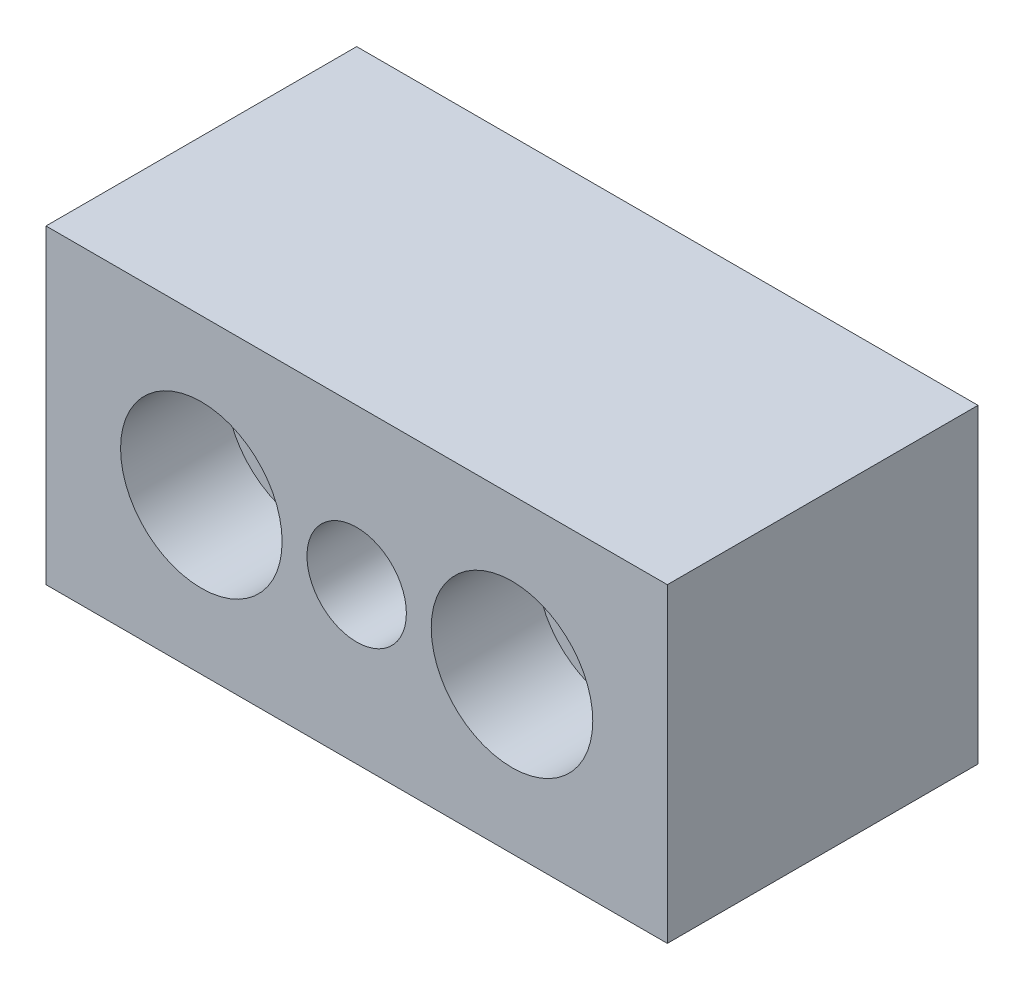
ISO-10303-21;
HEADER;
FILE_DESCRIPTION(('STEP AP214'),'2;1');
FILE_NAME('part.step','',(''),(''),'','','');
FILE_SCHEMA(('AUTOMOTIVE_DESIGN { 1 0 10303 214 1 1 1 1 }'));
ENDSEC;
DATA;
#1=APPLICATION_CONTEXT('core data for automotive mechanical design processes');
#2=APPLICATION_PROTOCOL_DEFINITION('international standard','automotive_design',2000,#1);
#3=PRODUCT_CONTEXT('',#1,'mechanical');
#4=PRODUCT('Part','Part','',(#3));
#5=PRODUCT_RELATED_PRODUCT_CATEGORY('part','',(#4));
#6=PRODUCT_DEFINITION_FORMATION('','',#4);
#7=PRODUCT_DEFINITION_CONTEXT('part definition',#1,'design');
#8=PRODUCT_DEFINITION('design','',#6,#7);
#9=PRODUCT_DEFINITION_SHAPE('','',#8);
#10=(LENGTH_UNIT() NAMED_UNIT(*) SI_UNIT(.MILLI.,.METRE.));
#11=(NAMED_UNIT(*) PLANE_ANGLE_UNIT() SI_UNIT($,.RADIAN.));
#12=(NAMED_UNIT(*) SI_UNIT($,.STERADIAN.) SOLID_ANGLE_UNIT());
#13=UNCERTAINTY_MEASURE_WITH_UNIT(LENGTH_MEASURE(1.E-05),#10,'distance_accuracy_value','');
#14=(GEOMETRIC_REPRESENTATION_CONTEXT(3) GLOBAL_UNCERTAINTY_ASSIGNED_CONTEXT((#13)) GLOBAL_UNIT_ASSIGNED_CONTEXT((#10,
#11,#12)) REPRESENTATION_CONTEXT('',''));
#15=CARTESIAN_POINT('',(0.,0.,0.));
#16=DIRECTION('',(0.,0.,1.));
#17=DIRECTION('',(1.,0.,0.));
#18=AXIS2_PLACEMENT_3D('',#15,#16,#17);
#19=CARTESIAN_POINT('',(-25.,25.,50.));
#20=DIRECTION('',(0.,0.,-1.));
#21=DIRECTION('',(-1.,0.,0.));
#22=AXIS2_PLACEMENT_3D('',#19,#20,#21);
#23=PLANE('',#22);
#24=CARTESIAN_POINT('',(25.,0.,50.));
#25=DIRECTION('',(0.,0.,1.));
#26=DIRECTION('',(1.,0.,0.));
#27=AXIS2_PLACEMENT_3D('',#24,#25,#26);
#28=CIRCLE('',#27,8.);
#29=CARTESIAN_POINT('',(33.,0.,50.));
#30=VERTEX_POINT('',#29);
#31=EDGE_CURVE('E147',#30,#30,#28,.T.);
#32=ORIENTED_EDGE('',*,*,#31,.F.);
#33=EDGE_LOOP('',(#32));
#34=FACE_BOUND('',#33,.T.);
#35=CARTESIAN_POINT('',(0.,0.,50.));
#36=DIRECTION('',(0.,0.,1.));
#37=DIRECTION('',(1.,0.,0.));
#38=AXIS2_PLACEMENT_3D('',#35,#36,#37);
#39=CIRCLE('',#38,13.);
#40=CARTESIAN_POINT('',(13.,0.,50.));
#41=VERTEX_POINT('',#40);
#42=EDGE_CURVE('E84',#41,#41,#39,.T.);
#43=ORIENTED_EDGE('',*,*,#42,.F.);
#44=EDGE_LOOP('',(#43));
#45=FACE_BOUND('',#44,.T.);
#46=DIRECTION('',(0.,1.,0.));
#47=VECTOR('',#46,1.);
#48=CARTESIAN_POINT('',(-25.,-25.,50.));
#49=LINE('',#48,#47);
#50=CARTESIAN_POINT('',(-25.,-25.,50.));
#51=VERTEX_POINT('',#50);
#52=CARTESIAN_POINT('',(-25.,25.,50.));
#53=VERTEX_POINT('',#52);
#54=EDGE_CURVE('E66',#51,#53,#49,.T.);
#55=ORIENTED_EDGE('',*,*,#54,.F.);
#56=DIRECTION('',(-1.,0.,0.));
#57=VECTOR('',#56,1.);
#58=CARTESIAN_POINT('',(75.,-25.,50.));
#59=LINE('',#58,#57);
#60=CARTESIAN_POINT('',(75.,-25.,50.));
#61=VERTEX_POINT('',#60);
#62=EDGE_CURVE('E48',#61,#51,#59,.T.);
#63=ORIENTED_EDGE('',*,*,#62,.F.);
#64=DIRECTION('',(0.,-1.,0.));
#65=VECTOR('',#64,1.);
#66=CARTESIAN_POINT('',(75.,25.,50.));
#67=LINE('',#66,#65);
#68=CARTESIAN_POINT('',(75.,25.,50.));
#69=VERTEX_POINT('',#68);
#70=EDGE_CURVE('E57',#69,#61,#67,.T.);
#71=ORIENTED_EDGE('',*,*,#70,.F.);
#72=DIRECTION('',(1.,0.,0.));
#73=VECTOR('',#72,1.);
#74=CARTESIAN_POINT('',(-25.,25.,50.));
#75=LINE('',#74,#73);
#76=EDGE_CURVE('E62',#53,#69,#75,.T.);
#77=ORIENTED_EDGE('',*,*,#76,.F.);
#78=EDGE_LOOP('',(#55,#63,#71,#77));
#79=FACE_BOUND('',#78,.T.);
#80=CARTESIAN_POINT('',(50.,0.,50.));
#81=DIRECTION('',(0.,0.,1.));
#82=DIRECTION('',(1.,0.,0.));
#83=AXIS2_PLACEMENT_3D('',#80,#81,#82);
#84=CIRCLE('',#83,13.);
#85=CARTESIAN_POINT('',(63.,0.,50.));
#86=VERTEX_POINT('',#85);
#87=EDGE_CURVE('E160',#86,#86,#84,.T.);
#88=ORIENTED_EDGE('',*,*,#87,.F.);
#89=EDGE_LOOP('',(#88));
#90=FACE_BOUND('',#89,.T.);
#91=ADVANCED_FACE('F14',(#34,#45,#79,#90),#23,.F.);
#92=CARTESIAN_POINT('',(-25.,25.,0.));
#93=DIRECTION('',(0.,0.,-1.));
#94=DIRECTION('',(-1.,0.,0.));
#95=AXIS2_PLACEMENT_3D('',#92,#93,#94);
#96=PLANE('',#95);
#97=CARTESIAN_POINT('',(0.,0.,0.));
#98=DIRECTION('',(0.,0.,1.));
#99=DIRECTION('',(1.,0.,0.));
#100=AXIS2_PLACEMENT_3D('',#97,#98,#99);
#101=CIRCLE('',#100,9.);
#102=CARTESIAN_POINT('',(9.,0.,0.));
#103=VERTEX_POINT('',#102);
#104=EDGE_CURVE('E163',#103,#103,#101,.T.);
#105=ORIENTED_EDGE('',*,*,#104,.T.);
#106=EDGE_LOOP('',(#105));
#107=FACE_BOUND('',#106,.T.);
#108=DIRECTION('',(0.,1.,0.));
#109=VECTOR('',#108,1.);
#110=CARTESIAN_POINT('',(-25.,-25.,0.));
#111=LINE('',#110,#109);
#112=CARTESIAN_POINT('',(-25.,-25.,0.));
#113=VERTEX_POINT('',#112);
#114=CARTESIAN_POINT('',(-25.,25.,0.));
#115=VERTEX_POINT('',#114);
#116=EDGE_CURVE('E67',#113,#115,#111,.T.);
#117=ORIENTED_EDGE('',*,*,#116,.T.);
#118=DIRECTION('',(1.,0.,0.));
#119=VECTOR('',#118,1.);
#120=CARTESIAN_POINT('',(-25.,25.,0.));
#121=LINE('',#120,#119);
#122=CARTESIAN_POINT('',(75.,25.,0.));
#123=VERTEX_POINT('',#122);
#124=EDGE_CURVE('E70',#115,#123,#121,.T.);
#125=ORIENTED_EDGE('',*,*,#124,.T.);
#126=DIRECTION('',(0.,-1.,0.));
#127=VECTOR('',#126,1.);
#128=CARTESIAN_POINT('',(75.,25.,0.));
#129=LINE('',#128,#127);
#130=CARTESIAN_POINT('',(75.,-25.,0.));
#131=VERTEX_POINT('',#130);
#132=EDGE_CURVE('E80',#123,#131,#129,.T.);
#133=ORIENTED_EDGE('',*,*,#132,.T.);
#134=DIRECTION('',(-1.,0.,0.));
#135=VECTOR('',#134,1.);
#136=CARTESIAN_POINT('',(75.,-25.,0.));
#137=LINE('',#136,#135);
#138=EDGE_CURVE('E51',#131,#113,#137,.T.);
#139=ORIENTED_EDGE('',*,*,#138,.T.);
#140=EDGE_LOOP('',(#117,#125,#133,#139));
#141=FACE_BOUND('',#140,.T.);
#142=CARTESIAN_POINT('',(50.,0.,0.));
#143=DIRECTION('',(0.,0.,1.));
#144=DIRECTION('',(1.,0.,0.));
#145=AXIS2_PLACEMENT_3D('',#142,#143,#144);
#146=CIRCLE('',#145,9.);
#147=CARTESIAN_POINT('',(59.,0.,0.));
#148=VERTEX_POINT('',#147);
#149=EDGE_CURVE('E146',#148,#148,#146,.T.);
#150=ORIENTED_EDGE('',*,*,#149,.T.);
#151=EDGE_LOOP('',(#150));
#152=FACE_BOUND('',#151,.T.);
#153=ADVANCED_FACE('F78',(#107,#141,#152),#96,.T.);
#154=CARTESIAN_POINT('',(-25.,-25.,50.));
#155=DIRECTION('',(-1.,0.,0.));
#156=DIRECTION('',(0.,0.,1.));
#157=AXIS2_PLACEMENT_3D('',#154,#155,#156);
#158=PLANE('',#157);
#159=DIRECTION('',(0.,0.,-1.));
#160=VECTOR('',#159,1.);
#161=CARTESIAN_POINT('',(-25.,-25.,50.));
#162=LINE('',#161,#160);
#163=EDGE_CURVE('E9',#51,#113,#162,.T.);
#164=ORIENTED_EDGE('',*,*,#163,.F.);
#165=ORIENTED_EDGE('',*,*,#54,.T.);
#166=DIRECTION('',(0.,0.,-1.));
#167=VECTOR('',#166,1.);
#168=CARTESIAN_POINT('',(-25.,25.,50.));
#169=LINE('',#168,#167);
#170=EDGE_CURVE('E30',#53,#115,#169,.T.);
#171=ORIENTED_EDGE('',*,*,#170,.T.);
#172=ORIENTED_EDGE('',*,*,#116,.F.);
#173=EDGE_LOOP('',(#164,#165,#171,#172));
#174=FACE_BOUND('',#173,.T.);
#175=ADVANCED_FACE('F88',(#174),#158,.T.);
#176=CARTESIAN_POINT('',(75.,-25.,50.));
#177=DIRECTION('',(0.,-1.,0.));
#178=DIRECTION('',(1.,0.,0.));
#179=AXIS2_PLACEMENT_3D('',#176,#177,#178);
#180=PLANE('',#179);
#181=DIRECTION('',(0.,0.,-1.));
#182=VECTOR('',#181,1.);
#183=CARTESIAN_POINT('',(75.,-25.,50.));
#184=LINE('',#183,#182);
#185=EDGE_CURVE('E23',#61,#131,#184,.T.);
#186=ORIENTED_EDGE('',*,*,#185,.F.);
#187=ORIENTED_EDGE('',*,*,#62,.T.);
#188=ORIENTED_EDGE('',*,*,#163,.T.);
#189=ORIENTED_EDGE('',*,*,#138,.F.);
#190=EDGE_LOOP('',(#186,#187,#188,#189));
#191=FACE_BOUND('',#190,.T.);
#192=ADVANCED_FACE('F16',(#191),#180,.T.);
#193=CARTESIAN_POINT('',(75.,25.,50.));
#194=DIRECTION('',(1.,0.,0.));
#195=DIRECTION('',(0.,1.,0.));
#196=AXIS2_PLACEMENT_3D('',#193,#194,#195);
#197=PLANE('',#196);
#198=DIRECTION('',(0.,0.,-1.));
#199=VECTOR('',#198,1.);
#200=CARTESIAN_POINT('',(75.,25.,50.));
#201=LINE('',#200,#199);
#202=EDGE_CURVE('E55',#69,#123,#201,.T.);
#203=ORIENTED_EDGE('',*,*,#202,.F.);
#204=ORIENTED_EDGE('',*,*,#70,.T.);
#205=ORIENTED_EDGE('',*,*,#185,.T.);
#206=ORIENTED_EDGE('',*,*,#132,.F.);
#207=EDGE_LOOP('',(#203,#204,#205,#206));
#208=FACE_BOUND('',#207,.T.);
#209=ADVANCED_FACE('F58',(#208),#197,.T.);
#210=CARTESIAN_POINT('',(-25.,25.,50.));
#211=DIRECTION('',(0.,1.,0.));
#212=DIRECTION('',(0.,0.,1.));
#213=AXIS2_PLACEMENT_3D('',#210,#211,#212);
#214=PLANE('',#213);
#215=ORIENTED_EDGE('',*,*,#76,.T.);
#216=ORIENTED_EDGE('',*,*,#202,.T.);
#217=ORIENTED_EDGE('',*,*,#124,.F.);
#218=ORIENTED_EDGE('',*,*,#170,.F.);
#219=EDGE_LOOP('',(#215,#216,#217,#218));
#220=FACE_BOUND('',#219,.T.);
#221=ADVANCED_FACE('F76',(#220),#214,.T.);
#222=CARTESIAN_POINT('',(0.,0.,50.));
#223=DIRECTION('',(0.,0.,1.));
#224=DIRECTION('',(1.,0.,0.));
#225=AXIS2_PLACEMENT_3D('',#222,#223,#224);
#226=CYLINDRICAL_SURFACE('',#225,13.);
#227=ORIENTED_EDGE('',*,*,#42,.T.);
#228=EDGE_LOOP('',(#227));
#229=FACE_BOUND('',#228,.T.);
#230=CARTESIAN_POINT('',(0.,0.,33.));
#231=DIRECTION('',(0.,0.,1.));
#232=DIRECTION('',(1.,0.,0.));
#233=AXIS2_PLACEMENT_3D('',#230,#231,#232);
#234=CIRCLE('',#233,13.);
#235=CARTESIAN_POINT('',(13.,0.,33.));
#236=VERTEX_POINT('',#235);
#237=EDGE_CURVE('E169',#236,#236,#234,.T.);
#238=ORIENTED_EDGE('',*,*,#237,.F.);
#239=EDGE_LOOP('',(#238));
#240=FACE_BOUND('',#239,.T.);
#241=ADVANCED_FACE('F110',(#229,#240),#226,.F.);
#242=CARTESIAN_POINT('',(9.,0.,33.));
#243=DIRECTION('',(0.,0.,1.));
#244=DIRECTION('',(1.,0.,0.));
#245=AXIS2_PLACEMENT_3D('',#242,#243,#244);
#246=PLANE('',#245);
#247=ORIENTED_EDGE('',*,*,#237,.T.);
#248=EDGE_LOOP('',(#247));
#249=FACE_BOUND('',#248,.T.);
#250=CARTESIAN_POINT('',(0.,0.,33.));
#251=DIRECTION('',(0.,0.,1.));
#252=DIRECTION('',(1.,0.,0.));
#253=AXIS2_PLACEMENT_3D('',#250,#251,#252);
#254=CIRCLE('',#253,9.);
#255=CARTESIAN_POINT('',(9.,0.,33.));
#256=VERTEX_POINT('',#255);
#257=EDGE_CURVE('E166',#256,#256,#254,.T.);
#258=ORIENTED_EDGE('',*,*,#257,.F.);
#259=EDGE_LOOP('',(#258));
#260=FACE_BOUND('',#259,.T.);
#261=ADVANCED_FACE('F113',(#249,#260),#246,.T.);
#262=CARTESIAN_POINT('',(0.,0.,50.));
#263=DIRECTION('',(0.,0.,1.));
#264=DIRECTION('',(1.,0.,0.));
#265=AXIS2_PLACEMENT_3D('',#262,#263,#264);
#266=CYLINDRICAL_SURFACE('',#265,9.);
#267=ORIENTED_EDGE('',*,*,#257,.T.);
#268=EDGE_LOOP('',(#267));
#269=FACE_BOUND('',#268,.T.);
#270=ORIENTED_EDGE('',*,*,#104,.F.);
#271=EDGE_LOOP('',(#270));
#272=FACE_BOUND('',#271,.T.);
#273=ADVANCED_FACE('F117',(#269,#272),#266,.F.);
#274=CARTESIAN_POINT('',(50.,0.,50.));
#275=DIRECTION('',(0.,0.,1.));
#276=DIRECTION('',(1.,0.,0.));
#277=AXIS2_PLACEMENT_3D('',#274,#275,#276);
#278=CYLINDRICAL_SURFACE('',#277,13.);
#279=ORIENTED_EDGE('',*,*,#87,.T.);
#280=EDGE_LOOP('',(#279));
#281=FACE_BOUND('',#280,.T.);
#282=CARTESIAN_POINT('',(50.,0.,33.));
#283=DIRECTION('',(0.,0.,1.));
#284=DIRECTION('',(1.,0.,0.));
#285=AXIS2_PLACEMENT_3D('',#282,#283,#284);
#286=CIRCLE('',#285,13.);
#287=CARTESIAN_POINT('',(63.,0.,33.));
#288=VERTEX_POINT('',#287);
#289=EDGE_CURVE('E157',#288,#288,#286,.T.);
#290=ORIENTED_EDGE('',*,*,#289,.F.);
#291=EDGE_LOOP('',(#290));
#292=FACE_BOUND('',#291,.T.);
#293=ADVANCED_FACE('F121',(#281,#292),#278,.F.);
#294=CARTESIAN_POINT('',(59.,0.,33.));
#295=DIRECTION('',(0.,0.,1.));
#296=DIRECTION('',(1.,0.,0.));
#297=AXIS2_PLACEMENT_3D('',#294,#295,#296);
#298=PLANE('',#297);
#299=ORIENTED_EDGE('',*,*,#289,.T.);
#300=EDGE_LOOP('',(#299));
#301=FACE_BOUND('',#300,.T.);
#302=CARTESIAN_POINT('',(50.,0.,33.));
#303=DIRECTION('',(0.,0.,1.));
#304=DIRECTION('',(1.,0.,0.));
#305=AXIS2_PLACEMENT_3D('',#302,#303,#304);
#306=CIRCLE('',#305,9.);
#307=CARTESIAN_POINT('',(59.,0.,33.));
#308=VERTEX_POINT('',#307);
#309=EDGE_CURVE('E150',#308,#308,#306,.T.);
#310=ORIENTED_EDGE('',*,*,#309,.F.);
#311=EDGE_LOOP('',(#310));
#312=FACE_BOUND('',#311,.T.);
#313=ADVANCED_FACE('F125',(#301,#312),#298,.T.);
#314=CARTESIAN_POINT('',(50.,0.,50.));
#315=DIRECTION('',(0.,0.,1.));
#316=DIRECTION('',(1.,0.,0.));
#317=AXIS2_PLACEMENT_3D('',#314,#315,#316);
#318=CYLINDRICAL_SURFACE('',#317,9.);
#319=ORIENTED_EDGE('',*,*,#309,.T.);
#320=EDGE_LOOP('',(#319));
#321=FACE_BOUND('',#320,.T.);
#322=ORIENTED_EDGE('',*,*,#149,.F.);
#323=EDGE_LOOP('',(#322));
#324=FACE_BOUND('',#323,.T.);
#325=ADVANCED_FACE('F129',(#321,#324),#318,.F.);
#326=CARTESIAN_POINT('',(25.,0.,15.));
#327=DIRECTION('',(0.,0.,1.));
#328=DIRECTION('',(1.,0.,0.));
#329=AXIS2_PLACEMENT_3D('',#326,#327,#328);
#330=CYLINDRICAL_SURFACE('',#329,8.);
#331=CARTESIAN_POINT('',(25.,0.,15.));
#332=DIRECTION('',(0.,0.,1.));
#333=DIRECTION('',(1.,0.,0.));
#334=AXIS2_PLACEMENT_3D('',#331,#332,#333);
#335=CIRCLE('',#334,8.);
#336=CARTESIAN_POINT('',(33.,0.,15.));
#337=VERTEX_POINT('',#336);
#338=EDGE_CURVE('E145',#337,#337,#335,.T.);
#339=ORIENTED_EDGE('',*,*,#338,.F.);
#340=EDGE_LOOP('',(#339));
#341=FACE_BOUND('',#340,.T.);
#342=ORIENTED_EDGE('',*,*,#31,.T.);
#343=EDGE_LOOP('',(#342));
#344=FACE_BOUND('',#343,.T.);
#345=ADVANCED_FACE('F133',(#341,#344),#330,.F.);
#346=CARTESIAN_POINT('',(25.,0.,15.));
#347=DIRECTION('',(0.,0.,1.));
#348=DIRECTION('',(1.,0.,0.));
#349=AXIS2_PLACEMENT_3D('',#346,#347,#348);
#350=PLANE('',#349);
#351=ORIENTED_EDGE('',*,*,#338,.T.);
#352=EDGE_LOOP('',(#351));
#353=FACE_BOUND('',#352,.T.);
#354=ADVANCED_FACE('F135',(#353),#350,.T.);
#355=CLOSED_SHELL('',(#91,#153,#175,#192,#209,#221,#241,#261,#273,#293,#313,#325,#345,#354));
#356=MANIFOLD_SOLID_BREP('B1',#355);
#357=ADVANCED_BREP_SHAPE_REPRESENTATION('',(#18,#356),#14);
#358=SHAPE_DEFINITION_REPRESENTATION(#9,#357);
ENDSEC;
END-ISO-10303-21;
